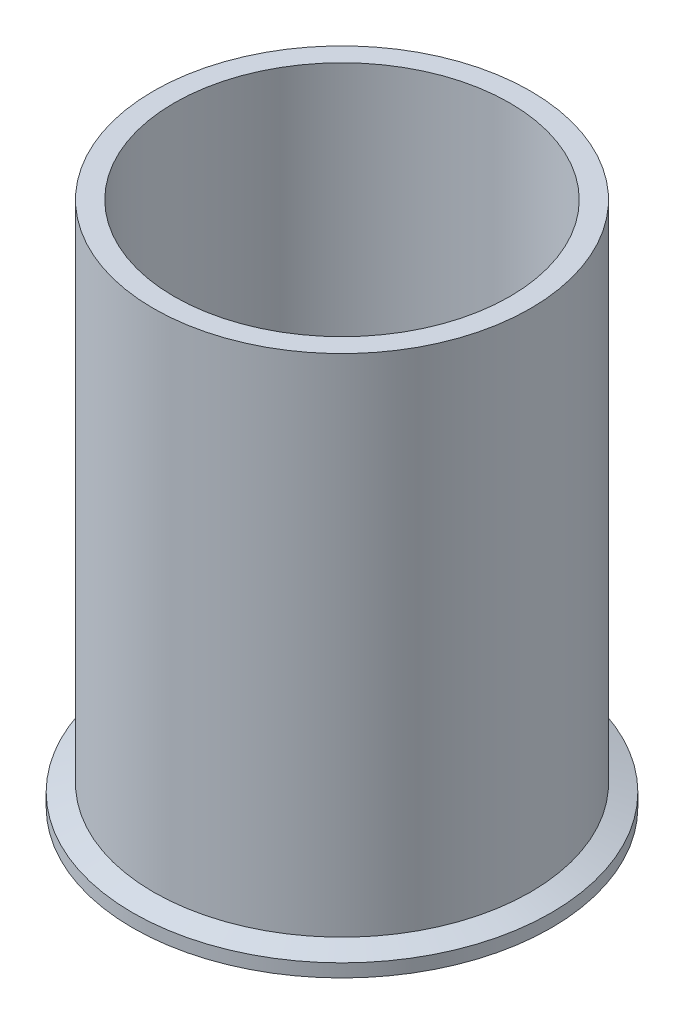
from build123d import *


with BuildPart() as part:
    # Sketch1 → Revolve2 (revolve)
    with BuildSketch(Plane.XY, mode=Mode.PRIVATE) as revolve2_sk:
        with BuildLine():
            Line((-36.449, 0), (-36.449, 114.3))
            Line((-36.449, 114.3), (-40.9448, 114.3))
            Line((-40.9448, 114.3), (-40.9448, 4.485759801))
            Line((-40.9448, 4.485759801), (-45.4533, 2.8448))
            Line((-45.4533, 2.8448), (-45.4533, 0))
            Line((-45.4533, 0), (-43.486708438, 0))
            ThreePointArc((-43.486708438, 0), (-43.054511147, 0.129217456), (-42.764166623, 0.474458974))
            ThreePointArc((-42.764166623, 0.474458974), (-41.6687, 1.1938), (-40.573233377, 0.474458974))
            ThreePointArc((-40.573233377, 0.474458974), (-40.282888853, 0.129217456), (-39.850691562, 0))
            Line((-39.850691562, 0), (-36.449, 0))
        make_face()
    revolve(revolve2_sk.sketch.rotate(Axis((0, 0, 0), (0, 1, 0)), 270), axis=Axis((0, 0, 0), (0, 1, 0)))


solid = part.part
